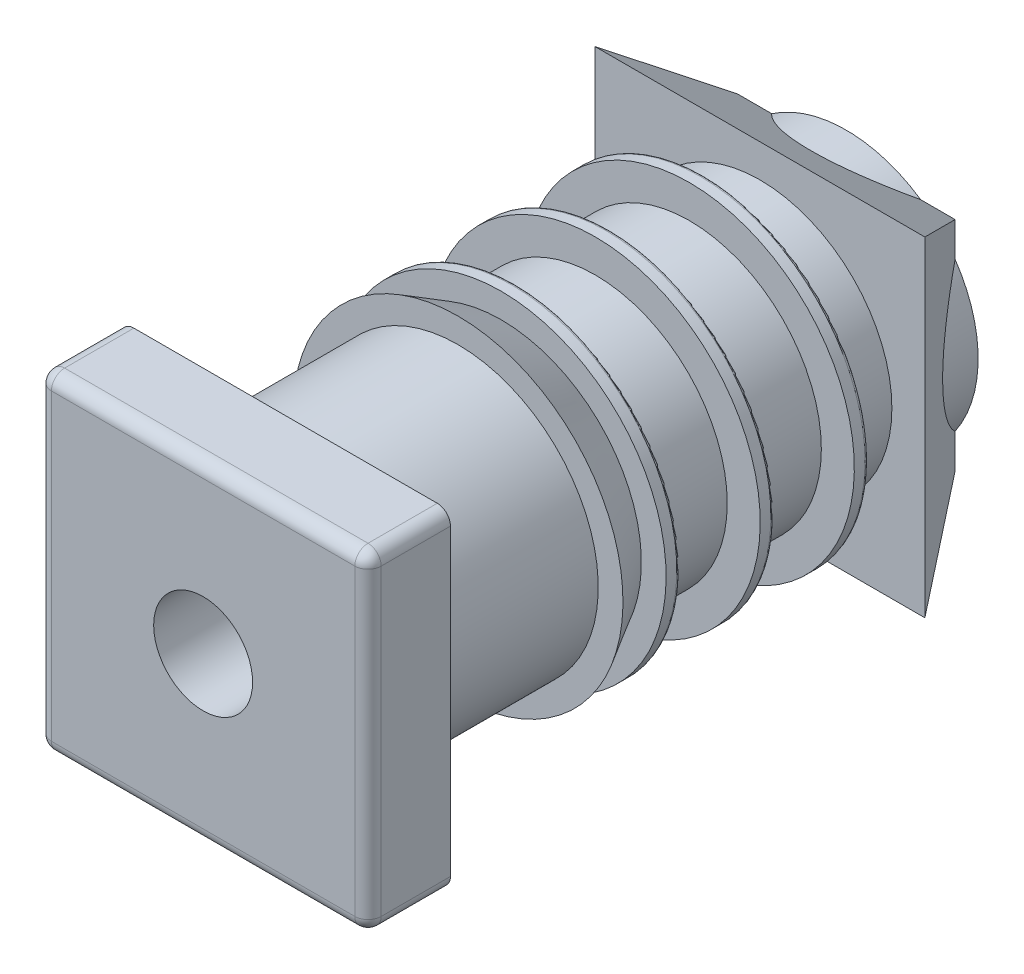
ISO-10303-21;
HEADER;
FILE_DESCRIPTION(('STEP AP214'),'2;1');
FILE_NAME('part.step','',(''),(''),'','','');
FILE_SCHEMA(('AUTOMOTIVE_DESIGN { 1 0 10303 214 1 1 1 1 }'));
ENDSEC;
DATA;
#1=APPLICATION_CONTEXT('core data for automotive mechanical design processes');
#2=APPLICATION_PROTOCOL_DEFINITION('international standard','automotive_design',2000,#1);
#3=PRODUCT_CONTEXT('',#1,'mechanical');
#4=PRODUCT('Part','Part','',(#3));
#5=PRODUCT_RELATED_PRODUCT_CATEGORY('part','',(#4));
#6=PRODUCT_DEFINITION_FORMATION('','',#4);
#7=PRODUCT_DEFINITION_CONTEXT('part definition',#1,'design');
#8=PRODUCT_DEFINITION('design','',#6,#7);
#9=PRODUCT_DEFINITION_SHAPE('','',#8);
#10=(LENGTH_UNIT() NAMED_UNIT(*) SI_UNIT(.MILLI.,.METRE.));
#11=(NAMED_UNIT(*) PLANE_ANGLE_UNIT() SI_UNIT($,.RADIAN.));
#12=(NAMED_UNIT(*) SI_UNIT($,.STERADIAN.) SOLID_ANGLE_UNIT());
#13=UNCERTAINTY_MEASURE_WITH_UNIT(LENGTH_MEASURE(1.E-05),#10,'distance_accuracy_value','');
#14=(GEOMETRIC_REPRESENTATION_CONTEXT(3) GLOBAL_UNCERTAINTY_ASSIGNED_CONTEXT((#13)) GLOBAL_UNIT_ASSIGNED_CONTEXT((#10,
#11,#12)) REPRESENTATION_CONTEXT('',''));
#15=CARTESIAN_POINT('',(0.,0.,0.));
#16=DIRECTION('',(0.,0.,1.));
#17=DIRECTION('',(1.,0.,0.));
#18=AXIS2_PLACEMENT_3D('',#15,#16,#17);
#19=CARTESIAN_POINT('',(-8.9,0.,-19.6340659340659));
#20=DIRECTION('',(0.,0.,-1.));
#21=DIRECTION('',(0.,-1.,0.));
#22=AXIS2_PLACEMENT_3D('',#19,#20,#21);
#23=PLANE('',#22);
#24=CARTESIAN_POINT('',(0.,0.,-19.6340659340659));
#25=DIRECTION('',(0.,0.,1.));
#26=DIRECTION('',(0.,-1.,0.));
#27=AXIS2_PLACEMENT_3D('',#24,#25,#26);
#28=CIRCLE('',#27,9.8);
#29=CARTESIAN_POINT('',(0.,-9.8,-19.6340659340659));
#30=VERTEX_POINT('',#29);
#31=CARTESIAN_POINT('',(0.,9.8,-19.6340659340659));
#32=VERTEX_POINT('',#31);
#33=EDGE_CURVE('E177',#30,#32,#28,.T.);
#34=ORIENTED_EDGE('',*,*,#33,.F.);
#35=CARTESIAN_POINT('',(0.,0.,-19.6340659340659));
#36=DIRECTION('',(0.,0.,1.));
#37=DIRECTION('',(-1.,0.,0.));
#38=AXIS2_PLACEMENT_3D('',#35,#36,#37);
#39=CIRCLE('',#38,9.8);
#40=CARTESIAN_POINT('',(-9.8,0.,-19.6340659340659));
#41=VERTEX_POINT('',#40);
#42=EDGE_CURVE('E170',#41,#30,#39,.T.);
#43=ORIENTED_EDGE('',*,*,#42,.F.);
#44=CARTESIAN_POINT('',(0.,0.,-19.6340659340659));
#45=DIRECTION('',(0.,0.,1.));
#46=DIRECTION('',(0.,1.,0.));
#47=AXIS2_PLACEMENT_3D('',#44,#45,#46);
#48=CIRCLE('',#47,9.8);
#49=EDGE_CURVE('E174',#32,#41,#48,.T.);
#50=ORIENTED_EDGE('',*,*,#49,.F.);
#51=EDGE_LOOP('',(#34,#43,#50));
#52=FACE_BOUND('',#51,.T.);
#53=CARTESIAN_POINT('',(0.,0.,-19.6340659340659));
#54=DIRECTION('',(0.,0.,1.));
#55=DIRECTION('',(0.,1.,0.));
#56=AXIS2_PLACEMENT_3D('',#53,#54,#55);
#57=CIRCLE('',#56,8.);
#58=CARTESIAN_POINT('',(0.,8.,-19.6340659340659));
#59=VERTEX_POINT('',#58);
#60=EDGE_CURVE('E187',#59,#59,#57,.F.);
#61=ORIENTED_EDGE('',*,*,#60,.F.);
#62=EDGE_LOOP('',(#61));
#63=FACE_BOUND('',#62,.T.);
#64=ADVANCED_FACE('F14',(#52,#63),#23,.T.);
#65=CARTESIAN_POINT('',(0.,0.,-22.0626373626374));
#66=DIRECTION('',(0.,0.,1.));
#67=DIRECTION('',(0.,1.,0.));
#68=AXIS2_PLACEMENT_3D('',#65,#66,#67);
#69=CYLINDRICAL_SURFACE('',#68,8.);
#70=CARTESIAN_POINT('',(0.,0.,-24.4912087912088));
#71=DIRECTION('',(0.,0.,1.));
#72=DIRECTION('',(0.,1.,0.));
#73=AXIS2_PLACEMENT_3D('',#70,#71,#72);
#74=CIRCLE('',#73,8.);
#75=CARTESIAN_POINT('',(0.,8.,-24.4912087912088));
#76=VERTEX_POINT('',#75);
#77=EDGE_CURVE('E338',#76,#76,#74,.F.);
#78=ORIENTED_EDGE('',*,*,#77,.F.);
#79=EDGE_LOOP('',(#78));
#80=FACE_BOUND('',#79,.T.);
#81=ORIENTED_EDGE('',*,*,#60,.T.);
#82=EDGE_LOOP('',(#81));
#83=FACE_BOUND('',#82,.T.);
#84=ADVANCED_FACE('F209',(#80,#83),#69,.T.);
#85=CARTESIAN_POINT('',(0.,0.,-19.4340659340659));
#86=DIRECTION('',(0.,0.,-1.));
#87=DIRECTION('',(0.,-1.,0.));
#88=AXIS2_PLACEMENT_3D('',#85,#86,#87);
#89=TOROIDAL_SURFACE('',#88,9.8,0.2);
#90=ORIENTED_EDGE('',*,*,#42,.T.);
#91=ORIENTED_EDGE('',*,*,#33,.T.);
#92=ORIENTED_EDGE('',*,*,#49,.T.);
#93=EDGE_LOOP('',(#90,#91,#92));
#94=FACE_BOUND('',#93,.T.);
#95=CARTESIAN_POINT('',(0.,0.,-19.4340659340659));
#96=DIRECTION('',(0.,0.,1.));
#97=DIRECTION('',(0.,1.,0.));
#98=AXIS2_PLACEMENT_3D('',#95,#96,#97);
#99=CIRCLE('',#98,10.);
#100=CARTESIAN_POINT('',(0.,10.,-19.4340659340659));
#101=VERTEX_POINT('',#100);
#102=EDGE_CURVE('E217',#101,#101,#99,.T.);
#103=ORIENTED_EDGE('',*,*,#102,.F.);
#104=EDGE_LOOP('',(#103));
#105=FACE_BOUND('',#104,.T.);
#106=ADVANCED_FACE('F184',(#94,#105),#89,.T.);
#107=CARTESIAN_POINT('',(-9.,0.,-24.4912087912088));
#108=DIRECTION('',(0.,0.,1.));
#109=DIRECTION('',(0.,1.,0.));
#110=AXIS2_PLACEMENT_3D('',#107,#108,#109);
#111=PLANE('',#110);
#112=ORIENTED_EDGE('',*,*,#77,.T.);
#113=EDGE_LOOP('',(#112));
#114=FACE_BOUND('',#113,.T.);
#115=CARTESIAN_POINT('',(0.,0.,-24.4912087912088));
#116=DIRECTION('',(0.,0.,1.));
#117=DIRECTION('',(0.,1.,0.));
#118=AXIS2_PLACEMENT_3D('',#115,#116,#117);
#119=CIRCLE('',#118,10.);
#120=CARTESIAN_POINT('',(0.,10.,-24.4912087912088));
#121=VERTEX_POINT('',#120);
#122=EDGE_CURVE('E335',#121,#121,#119,.F.);
#123=ORIENTED_EDGE('',*,*,#122,.F.);
#124=EDGE_LOOP('',(#123));
#125=FACE_BOUND('',#124,.T.);
#126=ADVANCED_FACE('F208',(#114,#125),#111,.T.);
#127=CARTESIAN_POINT('',(0.,0.,-19.1090659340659));
#128=DIRECTION('',(0.,0.,1.));
#129=DIRECTION('',(0.,1.,0.));
#130=AXIS2_PLACEMENT_3D('',#127,#128,#129);
#131=CYLINDRICAL_SURFACE('',#130,10.);
#132=ORIENTED_EDGE('',*,*,#102,.T.);
#133=EDGE_LOOP('',(#132));
#134=FACE_BOUND('',#133,.T.);
#135=CARTESIAN_POINT('',(0.,0.,-18.7840659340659));
#136=DIRECTION('',(0.,0.,1.));
#137=DIRECTION('',(0.,1.,0.));
#138=AXIS2_PLACEMENT_3D('',#135,#136,#137);
#139=CIRCLE('',#138,10.);
#140=CARTESIAN_POINT('',(0.,10.,-18.7840659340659));
#141=VERTEX_POINT('',#140);
#142=EDGE_CURVE('E332',#141,#141,#139,.T.);
#143=ORIENTED_EDGE('',*,*,#142,.F.);
#144=EDGE_LOOP('',(#143));
#145=FACE_BOUND('',#144,.T.);
#146=ADVANCED_FACE('F481',(#134,#145),#131,.T.);
#147=CARTESIAN_POINT('',(0.,0.,-24.8162087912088));
#148=DIRECTION('',(0.,0.,1.));
#149=DIRECTION('',(0.,1.,0.));
#150=AXIS2_PLACEMENT_3D('',#147,#148,#149);
#151=CYLINDRICAL_SURFACE('',#150,10.);
#152=ORIENTED_EDGE('',*,*,#122,.T.);
#153=EDGE_LOOP('',(#152));
#154=FACE_BOUND('',#153,.T.);
#155=CARTESIAN_POINT('',(0.,0.,-25.1412087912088));
#156=DIRECTION('',(0.,0.,-1.));
#157=DIRECTION('',(0.,-1.,0.));
#158=AXIS2_PLACEMENT_3D('',#155,#156,#157);
#159=CIRCLE('',#158,10.);
#160=CARTESIAN_POINT('',(0.,-10.,-25.1412087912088));
#161=VERTEX_POINT('',#160);
#162=EDGE_CURVE('E331',#161,#161,#159,.T.);
#163=ORIENTED_EDGE('',*,*,#162,.F.);
#164=EDGE_LOOP('',(#163));
#165=FACE_BOUND('',#164,.T.);
#166=ADVANCED_FACE('F479',(#154,#165),#151,.T.);
#167=CARTESIAN_POINT('',(-9.,0.,-18.7840659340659));
#168=DIRECTION('',(0.,0.,1.));
#169=DIRECTION('',(0.,1.,0.));
#170=AXIS2_PLACEMENT_3D('',#167,#168,#169);
#171=PLANE('',#170);
#172=CARTESIAN_POINT('',(0.,0.,-18.7840659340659));
#173=DIRECTION('',(0.,0.,1.));
#174=DIRECTION('',(0.,1.,0.));
#175=AXIS2_PLACEMENT_3D('',#172,#173,#174);
#176=CIRCLE('',#175,8.);
#177=CARTESIAN_POINT('',(0.,8.,-18.7840659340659));
#178=VERTEX_POINT('',#177);
#179=EDGE_CURVE('E327',#178,#178,#176,.T.);
#180=ORIENTED_EDGE('',*,*,#179,.F.);
#181=EDGE_LOOP('',(#180));
#182=FACE_BOUND('',#181,.T.);
#183=ORIENTED_EDGE('',*,*,#142,.T.);
#184=EDGE_LOOP('',(#183));
#185=FACE_BOUND('',#184,.T.);
#186=ADVANCED_FACE('F459',(#182,#185),#171,.T.);
#187=CARTESIAN_POINT('',(0.,0.,-25.1412087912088));
#188=DIRECTION('',(0.,0.,-1.));
#189=DIRECTION('',(0.,-1.,0.));
#190=AXIS2_PLACEMENT_3D('',#187,#188,#189);
#191=TOROIDAL_SURFACE('',#190,9.8,0.2);
#192=ORIENTED_EDGE('',*,*,#162,.T.);
#193=EDGE_LOOP('',(#192));
#194=FACE_BOUND('',#193,.T.);
#195=CARTESIAN_POINT('',(0.,0.,-25.3412087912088));
#196=DIRECTION('',(0.,0.,1.));
#197=DIRECTION('',(0.,1.,0.));
#198=AXIS2_PLACEMENT_3D('',#195,#196,#197);
#199=CIRCLE('',#198,9.8);
#200=CARTESIAN_POINT('',(-9.8,0.,-25.3412087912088));
#201=VERTEX_POINT('',#200);
#202=CARTESIAN_POINT('',(0.,9.8,-25.3412087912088));
#203=VERTEX_POINT('',#202);
#204=EDGE_CURVE('E330',#201,#203,#199,.F.);
#205=ORIENTED_EDGE('',*,*,#204,.F.);
#206=CARTESIAN_POINT('',(0.,0.,-25.3412087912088));
#207=DIRECTION('',(0.,0.,1.));
#208=DIRECTION('',(-1.,0.,0.));
#209=AXIS2_PLACEMENT_3D('',#206,#207,#208);
#210=CIRCLE('',#209,9.8);
#211=CARTESIAN_POINT('',(0.,-9.8,-25.3412087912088));
#212=VERTEX_POINT('',#211);
#213=EDGE_CURVE('E326',#212,#201,#210,.F.);
#214=ORIENTED_EDGE('',*,*,#213,.F.);
#215=CARTESIAN_POINT('',(0.,0.,-25.3412087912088));
#216=DIRECTION('',(0.,0.,1.));
#217=DIRECTION('',(0.,-1.,0.));
#218=AXIS2_PLACEMENT_3D('',#215,#216,#217);
#219=CIRCLE('',#218,9.8);
#220=EDGE_CURVE('E433',#203,#212,#219,.F.);
#221=ORIENTED_EDGE('',*,*,#220,.F.);
#222=EDGE_LOOP('',(#205,#214,#221));
#223=FACE_BOUND('',#222,.T.);
#224=ADVANCED_FACE('F454',(#194,#223),#191,.T.);
#225=CARTESIAN_POINT('',(0.,0.,-16.3554945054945));
#226=DIRECTION('',(0.,0.,1.));
#227=DIRECTION('',(0.,1.,0.));
#228=AXIS2_PLACEMENT_3D('',#225,#226,#227);
#229=CYLINDRICAL_SURFACE('',#228,8.);
#230=ORIENTED_EDGE('',*,*,#179,.T.);
#231=EDGE_LOOP('',(#230));
#232=FACE_BOUND('',#231,.T.);
#233=CARTESIAN_POINT('',(0.,0.,-13.9269230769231));
#234=DIRECTION('',(0.,0.,1.));
#235=DIRECTION('',(0.,1.,0.));
#236=AXIS2_PLACEMENT_3D('',#233,#234,#235);
#237=CIRCLE('',#236,8.);
#238=CARTESIAN_POINT('',(0.,8.,-13.9269230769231));
#239=VERTEX_POINT('',#238);
#240=EDGE_CURVE('E323',#239,#239,#237,.T.);
#241=ORIENTED_EDGE('',*,*,#240,.F.);
#242=EDGE_LOOP('',(#241));
#243=FACE_BOUND('',#242,.T.);
#244=ADVANCED_FACE('F458',(#232,#243),#229,.T.);
#245=CARTESIAN_POINT('',(-8.9,0.,-25.3412087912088));
#246=DIRECTION('',(0.,0.,-1.));
#247=DIRECTION('',(0.,-1.,0.));
#248=AXIS2_PLACEMENT_3D('',#245,#246,#247);
#249=PLANE('',#248);
#250=ORIENTED_EDGE('',*,*,#220,.T.);
#251=ORIENTED_EDGE('',*,*,#213,.T.);
#252=ORIENTED_EDGE('',*,*,#204,.T.);
#253=EDGE_LOOP('',(#250,#251,#252));
#254=FACE_BOUND('',#253,.T.);
#255=CARTESIAN_POINT('',(0.,0.,-25.3412087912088));
#256=DIRECTION('',(0.,0.,1.));
#257=DIRECTION('',(0.,1.,0.));
#258=AXIS2_PLACEMENT_3D('',#255,#256,#257);
#259=CIRCLE('',#258,8.);
#260=CARTESIAN_POINT('',(0.,8.,-25.3412087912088));
#261=VERTEX_POINT('',#260);
#262=EDGE_CURVE('E319',#261,#261,#259,.F.);
#263=ORIENTED_EDGE('',*,*,#262,.F.);
#264=EDGE_LOOP('',(#263));
#265=FACE_BOUND('',#264,.T.);
#266=ADVANCED_FACE('F391',(#254,#265),#249,.T.);
#267=CARTESIAN_POINT('',(-8.9,0.,-13.9269230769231));
#268=DIRECTION('',(0.,0.,-1.));
#269=DIRECTION('',(0.,-1.,0.));
#270=AXIS2_PLACEMENT_3D('',#267,#268,#269);
#271=PLANE('',#270);
#272=CARTESIAN_POINT('',(0.,0.,-13.9269230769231));
#273=DIRECTION('',(0.,0.,1.));
#274=DIRECTION('',(0.,-1.,0.));
#275=AXIS2_PLACEMENT_3D('',#272,#273,#274);
#276=CIRCLE('',#275,9.8);
#277=CARTESIAN_POINT('',(0.,-9.8,-13.9269230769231));
#278=VERTEX_POINT('',#277);
#279=CARTESIAN_POINT('',(0.,9.8,-13.9269230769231));
#280=VERTEX_POINT('',#279);
#281=EDGE_CURVE('E318',#278,#280,#276,.T.);
#282=ORIENTED_EDGE('',*,*,#281,.F.);
#283=CARTESIAN_POINT('',(0.,0.,-13.9269230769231));
#284=DIRECTION('',(0.,0.,1.));
#285=DIRECTION('',(-1.,0.,0.));
#286=AXIS2_PLACEMENT_3D('',#283,#284,#285);
#287=CIRCLE('',#286,9.8);
#288=CARTESIAN_POINT('',(-9.8,0.,-13.9269230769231));
#289=VERTEX_POINT('',#288);
#290=EDGE_CURVE('E408',#289,#278,#287,.T.);
#291=ORIENTED_EDGE('',*,*,#290,.F.);
#292=CARTESIAN_POINT('',(0.,0.,-13.9269230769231));
#293=DIRECTION('',(0.,0.,1.));
#294=DIRECTION('',(0.,1.,0.));
#295=AXIS2_PLACEMENT_3D('',#292,#293,#294);
#296=CIRCLE('',#295,9.8);
#297=EDGE_CURVE('E322',#280,#289,#296,.T.);
#298=ORIENTED_EDGE('',*,*,#297,.F.);
#299=EDGE_LOOP('',(#282,#291,#298));
#300=FACE_BOUND('',#299,.T.);
#301=ORIENTED_EDGE('',*,*,#240,.T.);
#302=EDGE_LOOP('',(#301));
#303=FACE_BOUND('',#302,.T.);
#304=ADVANCED_FACE('F382',(#300,#303),#271,.T.);
#305=CARTESIAN_POINT('',(0.,0.,-29.6706043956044));
#306=DIRECTION('',(0.,0.,1.));
#307=DIRECTION('',(0.,1.,0.));
#308=AXIS2_PLACEMENT_3D('',#305,#306,#307);
#309=CYLINDRICAL_SURFACE('',#308,8.);
#310=ORIENTED_EDGE('',*,*,#262,.T.);
#311=EDGE_LOOP('',(#310));
#312=FACE_BOUND('',#311,.T.);
#313=CARTESIAN_POINT('',(0.,0.,-28.7692307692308));
#314=DIRECTION('',(0.,0.,1.));
#315=DIRECTION('',(0.,1.,0.));
#316=AXIS2_PLACEMENT_3D('',#313,#314,#315);
#317=CIRCLE('',#316,8.);
#318=CARTESIAN_POINT('',(0.,8.,-28.7692307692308));
#319=VERTEX_POINT('',#318);
#320=EDGE_CURVE('E314',#319,#319,#317,.F.);
#321=ORIENTED_EDGE('',*,*,#320,.F.);
#322=EDGE_LOOP('',(#321));
#323=FACE_BOUND('',#322,.T.);
#324=ADVANCED_FACE('F365',(#312,#323),#309,.T.);
#325=CARTESIAN_POINT('',(0.,0.,-13.7269230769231));
#326=DIRECTION('',(0.,0.,-1.));
#327=DIRECTION('',(0.,-1.,0.));
#328=AXIS2_PLACEMENT_3D('',#325,#326,#327);
#329=TOROIDAL_SURFACE('',#328,9.8,0.2);
#330=ORIENTED_EDGE('',*,*,#290,.T.);
#331=ORIENTED_EDGE('',*,*,#281,.T.);
#332=ORIENTED_EDGE('',*,*,#297,.T.);
#333=EDGE_LOOP('',(#330,#331,#332));
#334=FACE_BOUND('',#333,.T.);
#335=CARTESIAN_POINT('',(0.,0.,-13.7269230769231));
#336=DIRECTION('',(0.,0.,1.));
#337=DIRECTION('',(0.,1.,0.));
#338=AXIS2_PLACEMENT_3D('',#335,#336,#337);
#339=CIRCLE('',#338,10.);
#340=CARTESIAN_POINT('',(0.,10.,-13.7269230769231));
#341=VERTEX_POINT('',#340);
#342=EDGE_CURVE('E317',#341,#341,#339,.T.);
#343=ORIENTED_EDGE('',*,*,#342,.F.);
#344=EDGE_LOOP('',(#343));
#345=FACE_BOUND('',#344,.T.);
#346=ADVANCED_FACE('F353',(#334,#345),#329,.T.);
#347=CARTESIAN_POINT('',(10.,-10.,-28.7692307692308));
#348=DIRECTION('',(0.,0.,1.));
#349=DIRECTION('',(0.,1.,0.));
#350=AXIS2_PLACEMENT_3D('',#347,#348,#349);
#351=PLANE('',#350);
#352=DIRECTION('',(-1.,0.,0.));
#353=VECTOR('',#352,1.);
#354=CARTESIAN_POINT('',(-10.,-10.,-28.7692307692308));
#355=LINE('',#354,#353);
#356=CARTESIAN_POINT('',(-10.,-10.,-28.7692307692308));
#357=VERTEX_POINT('',#356);
#358=CARTESIAN_POINT('',(10.,-10.,-28.7692307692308));
#359=VERTEX_POINT('',#358);
#360=EDGE_CURVE('E313',#357,#359,#355,.F.);
#361=ORIENTED_EDGE('',*,*,#360,.T.);
#362=DIRECTION('',(0.,-1.,0.));
#363=VECTOR('',#362,1.);
#364=CARTESIAN_POINT('',(10.,-10.,-28.7692307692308));
#365=LINE('',#364,#363);
#366=CARTESIAN_POINT('',(10.,10.,-28.7692307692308));
#367=VERTEX_POINT('',#366);
#368=EDGE_CURVE('E623',#367,#359,#365,.T.);
#369=ORIENTED_EDGE('',*,*,#368,.F.);
#370=DIRECTION('',(-1.,0.,0.));
#371=VECTOR('',#370,1.);
#372=CARTESIAN_POINT('',(-10.,10.,-28.7692307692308));
#373=LINE('',#372,#371);
#374=CARTESIAN_POINT('',(-10.,10.,-28.7692307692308));
#375=VERTEX_POINT('',#374);
#376=EDGE_CURVE('E625',#367,#375,#373,.T.);
#377=ORIENTED_EDGE('',*,*,#376,.T.);
#378=DIRECTION('',(0.,-1.,0.));
#379=VECTOR('',#378,1.);
#380=CARTESIAN_POINT('',(-10.,-10.,-28.7692307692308));
#381=LINE('',#380,#379);
#382=EDGE_CURVE('E626',#357,#375,#381,.F.);
#383=ORIENTED_EDGE('',*,*,#382,.F.);
#384=EDGE_LOOP('',(#361,#369,#377,#383));
#385=FACE_BOUND('',#384,.T.);
#386=ORIENTED_EDGE('',*,*,#320,.T.);
#387=EDGE_LOOP('',(#386));
#388=FACE_BOUND('',#387,.T.);
#389=ADVANCED_FACE('F364',(#385,#388),#351,.T.);
#390=CARTESIAN_POINT('',(0.,0.,-13.4019230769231));
#391=DIRECTION('',(0.,0.,1.));
#392=DIRECTION('',(0.,1.,0.));
#393=AXIS2_PLACEMENT_3D('',#390,#391,#392);
#394=CYLINDRICAL_SURFACE('',#393,10.);
#395=ORIENTED_EDGE('',*,*,#342,.T.);
#396=EDGE_LOOP('',(#395));
#397=FACE_BOUND('',#396,.T.);
#398=CARTESIAN_POINT('',(0.,0.,-13.0769230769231));
#399=DIRECTION('',(0.,0.,1.));
#400=DIRECTION('',(0.,1.,0.));
#401=AXIS2_PLACEMENT_3D('',#398,#399,#400);
#402=CIRCLE('',#401,10.);
#403=CARTESIAN_POINT('',(0.,10.,-13.0769230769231));
#404=VERTEX_POINT('',#403);
#405=EDGE_CURVE('E297',#404,#404,#402,.T.);
#406=ORIENTED_EDGE('',*,*,#405,.F.);
#407=EDGE_LOOP('',(#406));
#408=FACE_BOUND('',#407,.T.);
#409=ADVANCED_FACE('F603',(#397,#408),#394,.T.);
#410=CARTESIAN_POINT('',(0.,0.,-29.6706043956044));
#411=DIRECTION('',(0.,0.,1.));
#412=DIRECTION('',(0.,1.,0.));
#413=AXIS2_PLACEMENT_3D('',#410,#411,#412);
#414=CYLINDRICAL_SURFACE('',#413,8.);
#415=CARTESIAN_POINT('',(0.,0.,-44.1678804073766));
#416=DIRECTION('',(0.,0.838670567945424,0.544639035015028));
#417=DIRECTION('',(0.,-0.544639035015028,0.838670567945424));
#418=AXIS2_PLACEMENT_3D('',#415,#416,#417);
#419=ELLIPSE('',#418,14.6886276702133,8.);
#420=CARTESIAN_POINT('',(4.51653484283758,-6.60309874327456,-34.));
#421=VERTEX_POINT('',#420);
#422=CARTESIAN_POINT('',(-4.51653484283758,-6.60309874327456,-34.));
#423=VERTEX_POINT('',#422);
#424=EDGE_CURVE('E119',#421,#423,#419,.F.);
#425=ORIENTED_EDGE('',*,*,#424,.T.);
#426=CARTESIAN_POINT('',(0.,0.,-34.));
#427=DIRECTION('',(0.,0.,1.));
#428=DIRECTION('',(0.,1.,0.));
#429=AXIS2_PLACEMENT_3D('',#426,#427,#428);
#430=CIRCLE('',#429,8.);
#431=EDGE_CURVE('E292',#421,#423,#430,.F.);
#432=ORIENTED_EDGE('',*,*,#431,.F.);
#433=EDGE_LOOP('',(#425,#432));
#434=FACE_BOUND('',#433,.T.);
#435=ADVANCED_FACE('F601',(#434),#414,.T.);
#436=CARTESIAN_POINT('',(-10.,-10.,-28.7692307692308));
#437=DIRECTION('',(0.,0.838670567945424,0.544639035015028));
#438=DIRECTION('',(0.,0.544639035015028,-0.838670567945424));
#439=AXIS2_PLACEMENT_3D('',#436,#437,#438);
#440=PLANE('',#439);
#441=DIRECTION('',(-1.,0.,0.));
#442=VECTOR('',#441,1.);
#443=CARTESIAN_POINT('',(-6.60309874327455,-6.60309874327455,-34.));
#444=LINE('',#443,#442);
#445=CARTESIAN_POINT('',(6.60309874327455,-6.60309874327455,-34.));
#446=VERTEX_POINT('',#445);
#447=EDGE_CURVE('E296',#446,#421,#444,.T.);
#448=ORIENTED_EDGE('',*,*,#447,.F.);
#449=DIRECTION('',(-0.47830007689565,0.478300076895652,-0.73651753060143));
#450=VECTOR('',#449,1.);
#451=CARTESIAN_POINT('',(10.,-10.,-28.7692307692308));
#452=LINE('',#451,#450);
#453=EDGE_CURVE('E126',#359,#446,#452,.T.);
#454=ORIENTED_EDGE('',*,*,#453,.F.);
#455=ORIENTED_EDGE('',*,*,#360,.F.);
#456=DIRECTION('',(-0.47830007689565,-0.478300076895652,0.73651753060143));
#457=VECTOR('',#456,1.);
#458=CARTESIAN_POINT('',(-6.60309874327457,-6.60309874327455,-34.));
#459=LINE('',#458,#457);
#460=CARTESIAN_POINT('',(-6.60309874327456,-6.60309874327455,-34.));
#461=VERTEX_POINT('',#460);
#462=EDGE_CURVE('E311',#461,#357,#459,.T.);
#463=ORIENTED_EDGE('',*,*,#462,.F.);
#464=DIRECTION('',(-1.,0.,0.));
#465=VECTOR('',#464,1.);
#466=CARTESIAN_POINT('',(-6.60309874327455,-6.60309874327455,-34.));
#467=LINE('',#466,#465);
#468=EDGE_CURVE('E295',#423,#461,#467,.T.);
#469=ORIENTED_EDGE('',*,*,#468,.F.);
#470=ORIENTED_EDGE('',*,*,#424,.F.);
#471=EDGE_LOOP('',(#448,#454,#455,#463,#469,#470));
#472=FACE_BOUND('',#471,.T.);
#473=ADVANCED_FACE('F597',(#472),#440,.F.);
#474=CARTESIAN_POINT('',(0.,0.,-29.6706043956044));
#475=DIRECTION('',(0.,0.,1.));
#476=DIRECTION('',(0.,1.,0.));
#477=AXIS2_PLACEMENT_3D('',#474,#475,#476);
#478=CYLINDRICAL_SURFACE('',#477,8.);
#479=CARTESIAN_POINT('',(0.,0.,-44.1678804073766));
#480=DIRECTION('',(-0.838670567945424,0.,-0.544639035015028));
#481=DIRECTION('',(-0.544639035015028,0.,0.838670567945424));
#482=AXIS2_PLACEMENT_3D('',#479,#480,#481);
#483=ELLIPSE('',#482,14.6886276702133,8.);
#484=CARTESIAN_POINT('',(-6.60309874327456,4.51653484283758,-34.));
#485=VERTEX_POINT('',#484);
#486=CARTESIAN_POINT('',(-6.60309874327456,-4.51653484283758,-34.));
#487=VERTEX_POINT('',#486);
#488=EDGE_CURVE('E308',#485,#487,#483,.F.);
#489=ORIENTED_EDGE('',*,*,#488,.F.);
#490=CARTESIAN_POINT('',(0.,0.,-34.));
#491=DIRECTION('',(0.,0.,1.));
#492=DIRECTION('',(0.,1.,0.));
#493=AXIS2_PLACEMENT_3D('',#490,#491,#492);
#494=CIRCLE('',#493,8.);
#495=EDGE_CURVE('E287',#487,#485,#494,.F.);
#496=ORIENTED_EDGE('',*,*,#495,.F.);
#497=EDGE_LOOP('',(#489,#496));
#498=FACE_BOUND('',#497,.T.);
#499=ADVANCED_FACE('F593',(#498),#478,.T.);
#500=CARTESIAN_POINT('',(-10.,-10.,-28.7692307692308));
#501=DIRECTION('',(-0.838670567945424,0.,-0.544639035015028));
#502=DIRECTION('',(0.544639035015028,0.,-0.838670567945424));
#503=AXIS2_PLACEMENT_3D('',#500,#501,#502);
#504=PLANE('',#503);
#505=DIRECTION('',(0.478300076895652,-0.47830007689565,-0.73651753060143));
#506=VECTOR('',#505,1.);
#507=CARTESIAN_POINT('',(-10.,10.,-28.7692307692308));
#508=LINE('',#507,#506);
#509=CARTESIAN_POINT('',(-6.60309874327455,6.60309874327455,-34.));
#510=VERTEX_POINT('',#509);
#511=EDGE_CURVE('E307',#375,#510,#508,.T.);
#512=ORIENTED_EDGE('',*,*,#511,.T.);
#513=DIRECTION('',(0.,-1.,0.));
#514=VECTOR('',#513,1.);
#515=CARTESIAN_POINT('',(-6.60309874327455,-10.,-34.));
#516=LINE('',#515,#514);
#517=EDGE_CURVE('E290',#485,#510,#516,.F.);
#518=ORIENTED_EDGE('',*,*,#517,.F.);
#519=ORIENTED_EDGE('',*,*,#488,.T.);
#520=DIRECTION('',(0.,-1.,0.));
#521=VECTOR('',#520,1.);
#522=CARTESIAN_POINT('',(-6.60309874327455,-10.,-34.));
#523=LINE('',#522,#521);
#524=EDGE_CURVE('E291',#461,#487,#523,.F.);
#525=ORIENTED_EDGE('',*,*,#524,.F.);
#526=ORIENTED_EDGE('',*,*,#462,.T.);
#527=ORIENTED_EDGE('',*,*,#382,.T.);
#528=EDGE_LOOP('',(#512,#518,#519,#525,#526,#527));
#529=FACE_BOUND('',#528,.T.);
#530=ADVANCED_FACE('F589',(#529),#504,.T.);
#531=CARTESIAN_POINT('',(0.,0.,-29.6706043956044));
#532=DIRECTION('',(0.,0.,1.));
#533=DIRECTION('',(0.,1.,0.));
#534=AXIS2_PLACEMENT_3D('',#531,#532,#533);
#535=CYLINDRICAL_SURFACE('',#534,8.);
#536=CARTESIAN_POINT('',(0.,0.,-44.1678804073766));
#537=DIRECTION('',(0.,-0.838670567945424,0.544639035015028));
#538=DIRECTION('',(0.,0.544639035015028,0.838670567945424));
#539=AXIS2_PLACEMENT_3D('',#536,#537,#538);
#540=ELLIPSE('',#539,14.6886276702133,8.);
#541=CARTESIAN_POINT('',(-4.5165348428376,6.60309874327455,-34.));
#542=VERTEX_POINT('',#541);
#543=CARTESIAN_POINT('',(4.5165348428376,6.60309874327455,-34.));
#544=VERTEX_POINT('',#543);
#545=EDGE_CURVE('E304',#542,#544,#540,.F.);
#546=ORIENTED_EDGE('',*,*,#545,.T.);
#547=CARTESIAN_POINT('',(0.,0.,-34.));
#548=DIRECTION('',(0.,0.,1.));
#549=DIRECTION('',(0.,1.,0.));
#550=AXIS2_PLACEMENT_3D('',#547,#548,#549);
#551=CIRCLE('',#550,8.);
#552=EDGE_CURVE('E282',#542,#544,#551,.F.);
#553=ORIENTED_EDGE('',*,*,#552,.F.);
#554=EDGE_LOOP('',(#546,#553));
#555=FACE_BOUND('',#554,.T.);
#556=ADVANCED_FACE('F585',(#555),#535,.T.);
#557=CARTESIAN_POINT('',(-10.,6.60309874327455,-34.));
#558=DIRECTION('',(0.,-0.838670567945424,0.544639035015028));
#559=DIRECTION('',(0.,0.544639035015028,0.838670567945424));
#560=AXIS2_PLACEMENT_3D('',#557,#558,#559);
#561=PLANE('',#560);
#562=DIRECTION('',(-1.,0.,0.));
#563=VECTOR('',#562,1.);
#564=CARTESIAN_POINT('',(-6.60309874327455,6.60309874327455,-34.));
#565=LINE('',#564,#563);
#566=EDGE_CURVE('E286',#510,#542,#565,.F.);
#567=ORIENTED_EDGE('',*,*,#566,.F.);
#568=ORIENTED_EDGE('',*,*,#511,.F.);
#569=ORIENTED_EDGE('',*,*,#376,.F.);
#570=DIRECTION('',(0.47830007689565,0.478300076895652,0.73651753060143));
#571=VECTOR('',#570,1.);
#572=CARTESIAN_POINT('',(6.60309874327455,6.60309874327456,-34.));
#573=LINE('',#572,#571);
#574=CARTESIAN_POINT('',(6.60309874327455,6.60309874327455,-34.));
#575=VERTEX_POINT('',#574);
#576=EDGE_CURVE('E306',#575,#367,#573,.T.);
#577=ORIENTED_EDGE('',*,*,#576,.F.);
#578=DIRECTION('',(-1.,0.,0.));
#579=VECTOR('',#578,1.);
#580=CARTESIAN_POINT('',(-6.60309874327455,6.60309874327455,-34.));
#581=LINE('',#580,#579);
#582=EDGE_CURVE('E285',#544,#575,#581,.F.);
#583=ORIENTED_EDGE('',*,*,#582,.F.);
#584=ORIENTED_EDGE('',*,*,#545,.F.);
#585=EDGE_LOOP('',(#567,#568,#569,#577,#583,#584));
#586=FACE_BOUND('',#585,.T.);
#587=ADVANCED_FACE('F582',(#586),#561,.F.);
#588=CARTESIAN_POINT('',(6.60309874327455,-10.,-34.));
#589=DIRECTION('',(0.838670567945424,0.,-0.544639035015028));
#590=DIRECTION('',(0.544639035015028,0.,0.838670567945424));
#591=AXIS2_PLACEMENT_3D('',#588,#589,#590);
#592=PLANE('',#591);
#593=ORIENTED_EDGE('',*,*,#453,.T.);
#594=DIRECTION('',(0.,-1.,0.));
#595=VECTOR('',#594,1.);
#596=CARTESIAN_POINT('',(6.60309874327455,-10.,-34.));
#597=LINE('',#596,#595);
#598=CARTESIAN_POINT('',(6.60309874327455,-4.5165348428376,-34.));
#599=VERTEX_POINT('',#598);
#600=EDGE_CURVE('E300',#599,#446,#597,.T.);
#601=ORIENTED_EDGE('',*,*,#600,.F.);
#602=CARTESIAN_POINT('',(0.,0.,-44.1678804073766));
#603=DIRECTION('',(0.838670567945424,0.,-0.544639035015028));
#604=DIRECTION('',(0.544639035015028,0.,0.838670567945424));
#605=AXIS2_PLACEMENT_3D('',#602,#603,#604);
#606=ELLIPSE('',#605,14.6886276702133,8.);
#607=CARTESIAN_POINT('',(6.60309874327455,4.5165348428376,-34.));
#608=VERTEX_POINT('',#607);
#609=EDGE_CURVE('E301',#608,#599,#606,.T.);
#610=ORIENTED_EDGE('',*,*,#609,.F.);
#611=DIRECTION('',(0.,-1.,0.));
#612=VECTOR('',#611,1.);
#613=CARTESIAN_POINT('',(6.60309874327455,-10.,-34.));
#614=LINE('',#613,#612);
#615=EDGE_CURVE('E281',#575,#608,#614,.T.);
#616=ORIENTED_EDGE('',*,*,#615,.F.);
#617=ORIENTED_EDGE('',*,*,#576,.T.);
#618=ORIENTED_EDGE('',*,*,#368,.T.);
#619=EDGE_LOOP('',(#593,#601,#610,#616,#617,#618));
#620=FACE_BOUND('',#619,.T.);
#621=ADVANCED_FACE('F578',(#620),#592,.T.);
#622=CARTESIAN_POINT('',(0.,0.,-29.6706043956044));
#623=DIRECTION('',(0.,0.,1.));
#624=DIRECTION('',(0.,1.,0.));
#625=AXIS2_PLACEMENT_3D('',#622,#623,#624);
#626=CYLINDRICAL_SURFACE('',#625,8.);
#627=ORIENTED_EDGE('',*,*,#609,.T.);
#628=CARTESIAN_POINT('',(0.,0.,-34.));
#629=DIRECTION('',(0.,0.,1.));
#630=DIRECTION('',(0.,1.,0.));
#631=AXIS2_PLACEMENT_3D('',#628,#629,#630);
#632=CIRCLE('',#631,8.);
#633=EDGE_CURVE('E278',#608,#599,#632,.F.);
#634=ORIENTED_EDGE('',*,*,#633,.F.);
#635=EDGE_LOOP('',(#627,#634));
#636=FACE_BOUND('',#635,.T.);
#637=ADVANCED_FACE('F574',(#636),#626,.T.);
#638=CARTESIAN_POINT('',(-9.25,0.,-13.0769230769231));
#639=DIRECTION('',(0.,0.,1.));
#640=DIRECTION('',(0.,1.,0.));
#641=AXIS2_PLACEMENT_3D('',#638,#639,#640);
#642=PLANE('',#641);
#643=CARTESIAN_POINT('',(0.,0.,-13.0769230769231));
#644=DIRECTION('',(0.,0.,1.));
#645=DIRECTION('',(0.,1.,0.));
#646=AXIS2_PLACEMENT_3D('',#643,#644,#645);
#647=CIRCLE('',#646,8.5);
#648=CARTESIAN_POINT('',(0.,8.5,-13.0769230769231));
#649=VERTEX_POINT('',#648);
#650=EDGE_CURVE('E275',#649,#649,#647,.T.);
#651=ORIENTED_EDGE('',*,*,#650,.F.);
#652=EDGE_LOOP('',(#651));
#653=FACE_BOUND('',#652,.T.);
#654=ORIENTED_EDGE('',*,*,#405,.T.);
#655=EDGE_LOOP('',(#654));
#656=FACE_BOUND('',#655,.T.);
#657=ADVANCED_FACE('F570',(#653,#656),#642,.T.);
#658=CARTESIAN_POINT('',(-6.60309874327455,-10.,-34.));
#659=DIRECTION('',(0.,0.,-1.));
#660=DIRECTION('',(0.,-1.,0.));
#661=AXIS2_PLACEMENT_3D('',#658,#659,#660);
#662=PLANE('',#661);
#663=ORIENTED_EDGE('',*,*,#615,.T.);
#664=ORIENTED_EDGE('',*,*,#633,.T.);
#665=ORIENTED_EDGE('',*,*,#600,.T.);
#666=ORIENTED_EDGE('',*,*,#447,.T.);
#667=ORIENTED_EDGE('',*,*,#431,.T.);
#668=ORIENTED_EDGE('',*,*,#468,.T.);
#669=ORIENTED_EDGE('',*,*,#524,.T.);
#670=ORIENTED_EDGE('',*,*,#495,.T.);
#671=ORIENTED_EDGE('',*,*,#517,.T.);
#672=ORIENTED_EDGE('',*,*,#566,.T.);
#673=ORIENTED_EDGE('',*,*,#552,.T.);
#674=ORIENTED_EDGE('',*,*,#582,.T.);
#675=EDGE_LOOP('',(#663,#664,#665,#666,#667,#668,#669,#670,#671,#672,#673,#674));
#676=FACE_BOUND('',#675,.T.);
#677=CARTESIAN_POINT('',(0.,0.,-34.));
#678=DIRECTION('',(0.,0.,-1.));
#679=DIRECTION('',(0.,-1.,0.));
#680=AXIS2_PLACEMENT_3D('',#677,#678,#679);
#681=CIRCLE('',#680,3.);
#682=CARTESIAN_POINT('',(0.,-3.,-34.));
#683=VERTEX_POINT('',#682);
#684=EDGE_CURVE('E711',#683,#683,#681,.T.);
#685=ORIENTED_EDGE('',*,*,#684,.F.);
#686=EDGE_LOOP('',(#685));
#687=FACE_BOUND('',#686,.T.);
#688=ADVANCED_FACE('F566',(#676,#687),#662,.T.);
#689=CARTESIAN_POINT('',(0.,0.,-10.4615384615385));
#690=DIRECTION('',(0.,0.,1.));
#691=DIRECTION('',(0.,1.,0.));
#692=AXIS2_PLACEMENT_3D('',#689,#690,#691);
#693=CONICAL_SURFACE('',#692,10.,0.520728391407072);
#694=ORIENTED_EDGE('',*,*,#650,.T.);
#695=EDGE_LOOP('',(#694));
#696=FACE_BOUND('',#695,.T.);
#697=CARTESIAN_POINT('',(0.,0.,-10.4615384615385));
#698=DIRECTION('',(0.,0.,1.));
#699=DIRECTION('',(0.,1.,0.));
#700=AXIS2_PLACEMENT_3D('',#697,#698,#699);
#701=CIRCLE('',#700,10.);
#702=CARTESIAN_POINT('',(0.,10.,-10.4615384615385));
#703=VERTEX_POINT('',#702);
#704=EDGE_CURVE('E272',#703,#703,#701,.T.);
#705=ORIENTED_EDGE('',*,*,#704,.F.);
#706=EDGE_LOOP('',(#705));
#707=FACE_BOUND('',#706,.T.);
#708=ADVANCED_FACE('F562',(#696,#707),#693,.T.);
#709=CARTESIAN_POINT('',(-9.25,0.,-10.4615384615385));
#710=DIRECTION('',(0.,0.,1.));
#711=DIRECTION('',(0.,1.,0.));
#712=AXIS2_PLACEMENT_3D('',#709,#710,#711);
#713=PLANE('',#712);
#714=CARTESIAN_POINT('',(0.,0.,-10.4615384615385));
#715=DIRECTION('',(0.,0.,1.));
#716=DIRECTION('',(0.,1.,0.));
#717=AXIS2_PLACEMENT_3D('',#714,#715,#716);
#718=CIRCLE('',#717,8.5);
#719=CARTESIAN_POINT('',(0.,8.5,-10.4615384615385));
#720=VERTEX_POINT('',#719);
#721=EDGE_CURVE('E269',#720,#720,#718,.T.);
#722=ORIENTED_EDGE('',*,*,#721,.F.);
#723=EDGE_LOOP('',(#722));
#724=FACE_BOUND('',#723,.T.);
#725=ORIENTED_EDGE('',*,*,#704,.T.);
#726=EDGE_LOOP('',(#725));
#727=FACE_BOUND('',#726,.T.);
#728=ADVANCED_FACE('F558',(#724,#727),#713,.T.);
#729=CARTESIAN_POINT('',(0.,0.,-2.73076923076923));
#730=DIRECTION('',(0.,0.,1.));
#731=DIRECTION('',(0.,1.,0.));
#732=AXIS2_PLACEMENT_3D('',#729,#730,#731);
#733=CYLINDRICAL_SURFACE('',#732,8.5);
#734=CARTESIAN_POINT('',(0.,0.,0.));
#735=DIRECTION('',(0.,0.,1.));
#736=DIRECTION('',(0.,1.,0.));
#737=AXIS2_PLACEMENT_3D('',#734,#735,#736);
#738=CIRCLE('',#737,8.5);
#739=CARTESIAN_POINT('',(0.,8.5,0.));
#740=VERTEX_POINT('',#739);
#741=EDGE_CURVE('E260',#740,#740,#738,.T.);
#742=ORIENTED_EDGE('',*,*,#741,.F.);
#743=EDGE_LOOP('',(#742));
#744=FACE_BOUND('',#743,.T.);
#745=ORIENTED_EDGE('',*,*,#721,.T.);
#746=EDGE_LOOP('',(#745));
#747=FACE_BOUND('',#746,.T.);
#748=ADVANCED_FACE('F554',(#744,#747),#733,.T.);
#749=CARTESIAN_POINT('',(9.2,-9.2,5.));
#750=DIRECTION('',(0.,0.,1.));
#751=DIRECTION('',(0.,1.,0.));
#752=AXIS2_PLACEMENT_3D('',#749,#750,#751);
#753=CYLINDRICAL_SURFACE('',#752,0.8);
#754=DIRECTION('',(0.,0.,-1.));
#755=VECTOR('',#754,1.);
#756=CARTESIAN_POINT('',(10.,-9.2,5.));
#757=LINE('',#756,#755);
#758=CARTESIAN_POINT('',(10.,-9.2,4.2));
#759=VERTEX_POINT('',#758);
#760=CARTESIAN_POINT('',(10.,-9.2,0.));
#761=VERTEX_POINT('',#760);
#762=EDGE_CURVE('E659',#759,#761,#757,.T.);
#763=ORIENTED_EDGE('',*,*,#762,.F.);
#764=CARTESIAN_POINT('',(9.2,-9.2,4.2));
#765=DIRECTION('',(0.,0.,1.));
#766=DIRECTION('',(1.,0.,0.));
#767=AXIS2_PLACEMENT_3D('',#764,#765,#766);
#768=CIRCLE('',#767,0.8);
#769=CARTESIAN_POINT('',(9.2,-10.,4.2));
#770=VERTEX_POINT('',#769);
#771=EDGE_CURVE('E705',#759,#770,#768,.F.);
#772=ORIENTED_EDGE('',*,*,#771,.T.);
#773=DIRECTION('',(0.,0.,-1.));
#774=VECTOR('',#773,1.);
#775=CARTESIAN_POINT('',(9.2,-10.,5.));
#776=LINE('',#775,#774);
#777=CARTESIAN_POINT('',(9.2,-10.,0.));
#778=VERTEX_POINT('',#777);
#779=EDGE_CURVE('E654',#778,#770,#776,.F.);
#780=ORIENTED_EDGE('',*,*,#779,.F.);
#781=CARTESIAN_POINT('',(9.2,-9.2,0.));
#782=DIRECTION('',(0.,0.,1.));
#783=DIRECTION('',(0.,1.,0.));
#784=AXIS2_PLACEMENT_3D('',#781,#782,#783);
#785=CIRCLE('',#784,0.8);
#786=EDGE_CURVE('E265',#761,#778,#785,.F.);
#787=ORIENTED_EDGE('',*,*,#786,.F.);
#788=EDGE_LOOP('',(#763,#772,#780,#787));
#789=FACE_BOUND('',#788,.T.);
#790=ADVANCED_FACE('F550',(#789),#753,.T.);
#791=CARTESIAN_POINT('',(9.2,9.2,5.));
#792=DIRECTION('',(0.,0.,1.));
#793=DIRECTION('',(0.,1.,0.));
#794=AXIS2_PLACEMENT_3D('',#791,#792,#793);
#795=CYLINDRICAL_SURFACE('',#794,0.8);
#796=DIRECTION('',(0.,0.,-1.));
#797=VECTOR('',#796,1.);
#798=CARTESIAN_POINT('',(9.2,10.,5.));
#799=LINE('',#798,#797);
#800=CARTESIAN_POINT('',(9.2,10.,4.2));
#801=VERTEX_POINT('',#800);
#802=CARTESIAN_POINT('',(9.2,10.,0.));
#803=VERTEX_POINT('',#802);
#804=EDGE_CURVE('E664',#801,#803,#799,.T.);
#805=ORIENTED_EDGE('',*,*,#804,.F.);
#806=CARTESIAN_POINT('',(9.2,9.2,4.2));
#807=DIRECTION('',(0.,0.,1.));
#808=DIRECTION('',(1.,0.,0.));
#809=AXIS2_PLACEMENT_3D('',#806,#807,#808);
#810=CIRCLE('',#809,0.8);
#811=CARTESIAN_POINT('',(10.,9.2,4.2));
#812=VERTEX_POINT('',#811);
#813=EDGE_CURVE('E9',#801,#812,#810,.F.);
#814=ORIENTED_EDGE('',*,*,#813,.T.);
#815=DIRECTION('',(0.,0.,-1.));
#816=VECTOR('',#815,1.);
#817=CARTESIAN_POINT('',(10.,9.2,5.));
#818=LINE('',#817,#816);
#819=CARTESIAN_POINT('',(10.,9.2,0.));
#820=VERTEX_POINT('',#819);
#821=EDGE_CURVE('E658',#820,#812,#818,.F.);
#822=ORIENTED_EDGE('',*,*,#821,.F.);
#823=CARTESIAN_POINT('',(9.2,9.2,0.));
#824=DIRECTION('',(0.,0.,1.));
#825=DIRECTION('',(0.,1.,0.));
#826=AXIS2_PLACEMENT_3D('',#823,#824,#825);
#827=CIRCLE('',#826,0.8);
#828=EDGE_CURVE('E267',#803,#820,#827,.F.);
#829=ORIENTED_EDGE('',*,*,#828,.F.);
#830=EDGE_LOOP('',(#805,#814,#822,#829));
#831=FACE_BOUND('',#830,.T.);
#832=ADVANCED_FACE('F546',(#831),#795,.T.);
#833=CARTESIAN_POINT('',(-9.2,9.2,5.));
#834=DIRECTION('',(0.,0.,1.));
#835=DIRECTION('',(0.,1.,0.));
#836=AXIS2_PLACEMENT_3D('',#833,#834,#835);
#837=CYLINDRICAL_SURFACE('',#836,0.8);
#838=DIRECTION('',(0.,0.,-1.));
#839=VECTOR('',#838,1.);
#840=CARTESIAN_POINT('',(-10.,9.2,5.));
#841=LINE('',#840,#839);
#842=CARTESIAN_POINT('',(-10.,9.2,4.2));
#843=VERTEX_POINT('',#842);
#844=CARTESIAN_POINT('',(-10.,9.2,0.));
#845=VERTEX_POINT('',#844);
#846=EDGE_CURVE('E669',#843,#845,#841,.T.);
#847=ORIENTED_EDGE('',*,*,#846,.F.);
#848=CARTESIAN_POINT('',(-9.2,9.2,4.2));
#849=DIRECTION('',(0.,0.,1.));
#850=DIRECTION('',(1.,0.,0.));
#851=AXIS2_PLACEMENT_3D('',#848,#849,#850);
#852=CIRCLE('',#851,0.8);
#853=CARTESIAN_POINT('',(-9.2,10.,4.2));
#854=VERTEX_POINT('',#853);
#855=EDGE_CURVE('E727',#843,#854,#852,.F.);
#856=ORIENTED_EDGE('',*,*,#855,.T.);
#857=DIRECTION('',(0.,0.,-1.));
#858=VECTOR('',#857,1.);
#859=CARTESIAN_POINT('',(-9.2,10.,5.));
#860=LINE('',#859,#858);
#861=CARTESIAN_POINT('',(-9.2,10.,0.));
#862=VERTEX_POINT('',#861);
#863=EDGE_CURVE('E663',#862,#854,#860,.F.);
#864=ORIENTED_EDGE('',*,*,#863,.F.);
#865=CARTESIAN_POINT('',(-9.2,9.2,0.));
#866=DIRECTION('',(0.,0.,1.));
#867=DIRECTION('',(0.,1.,0.));
#868=AXIS2_PLACEMENT_3D('',#865,#866,#867);
#869=CIRCLE('',#868,0.8);
#870=EDGE_CURVE('E263',#845,#862,#869,.F.);
#871=ORIENTED_EDGE('',*,*,#870,.F.);
#872=EDGE_LOOP('',(#847,#856,#864,#871));
#873=FACE_BOUND('',#872,.T.);
#874=ADVANCED_FACE('F542',(#873),#837,.T.);
#875=CARTESIAN_POINT('',(0.,0.,0.));
#876=DIRECTION('',(0.,0.,-1.));
#877=DIRECTION('',(0.,-1.,0.));
#878=AXIS2_PLACEMENT_3D('',#875,#876,#877);
#879=PLANE('',#878);
#880=ORIENTED_EDGE('',*,*,#741,.T.);
#881=EDGE_LOOP('',(#880));
#882=FACE_BOUND('',#881,.T.);
#883=ORIENTED_EDGE('',*,*,#870,.T.);
#884=DIRECTION('',(1.,0.,0.));
#885=VECTOR('',#884,1.);
#886=CARTESIAN_POINT('',(9.2,10.,0.));
#887=LINE('',#886,#885);
#888=EDGE_CURVE('E660',#803,#862,#887,.F.);
#889=ORIENTED_EDGE('',*,*,#888,.F.);
#890=ORIENTED_EDGE('',*,*,#828,.T.);
#891=DIRECTION('',(0.,-1.,0.));
#892=VECTOR('',#891,1.);
#893=CARTESIAN_POINT('',(10.,-9.2,0.));
#894=LINE('',#893,#892);
#895=EDGE_CURVE('E655',#761,#820,#894,.F.);
#896=ORIENTED_EDGE('',*,*,#895,.F.);
#897=ORIENTED_EDGE('',*,*,#786,.T.);
#898=DIRECTION('',(-1.,0.,0.));
#899=VECTOR('',#898,1.);
#900=CARTESIAN_POINT('',(-9.2,-10.,0.));
#901=LINE('',#900,#899);
#902=CARTESIAN_POINT('',(-9.2,-10.,0.));
#903=VERTEX_POINT('',#902);
#904=EDGE_CURVE('E651',#903,#778,#901,.F.);
#905=ORIENTED_EDGE('',*,*,#904,.F.);
#906=CARTESIAN_POINT('',(-9.2,-9.2,0.));
#907=DIRECTION('',(0.,0.,1.));
#908=DIRECTION('',(0.,1.,0.));
#909=AXIS2_PLACEMENT_3D('',#906,#907,#908);
#910=CIRCLE('',#909,0.8);
#911=CARTESIAN_POINT('',(-10.,-9.2,0.));
#912=VERTEX_POINT('',#911);
#913=EDGE_CURVE('E252',#912,#903,#910,.T.);
#914=ORIENTED_EDGE('',*,*,#913,.F.);
#915=DIRECTION('',(0.,1.,0.));
#916=VECTOR('',#915,1.);
#917=CARTESIAN_POINT('',(-10.,9.2,0.));
#918=LINE('',#917,#916);
#919=EDGE_CURVE('E665',#845,#912,#918,.F.);
#920=ORIENTED_EDGE('',*,*,#919,.F.);
#921=EDGE_LOOP('',(#883,#889,#890,#896,#897,#905,#914,#920));
#922=FACE_BOUND('',#921,.T.);
#923=ADVANCED_FACE('F538',(#882,#922),#879,.T.);
#924=CARTESIAN_POINT('',(-9.2,-9.2,5.));
#925=DIRECTION('',(0.,0.,1.));
#926=DIRECTION('',(0.,1.,0.));
#927=AXIS2_PLACEMENT_3D('',#924,#925,#926);
#928=CYLINDRICAL_SURFACE('',#927,0.8);
#929=DIRECTION('',(0.,0.,-1.));
#930=VECTOR('',#929,1.);
#931=CARTESIAN_POINT('',(-9.2,-10.,5.));
#932=LINE('',#931,#930);
#933=CARTESIAN_POINT('',(-9.2,-10.,4.2));
#934=VERTEX_POINT('',#933);
#935=EDGE_CURVE('E259',#934,#903,#932,.T.);
#936=ORIENTED_EDGE('',*,*,#935,.F.);
#937=CARTESIAN_POINT('',(-9.2,-9.2,4.2));
#938=DIRECTION('',(0.,0.,1.));
#939=DIRECTION('',(1.,0.,0.));
#940=AXIS2_PLACEMENT_3D('',#937,#938,#939);
#941=CIRCLE('',#940,0.8);
#942=CARTESIAN_POINT('',(-10.,-9.2,4.2));
#943=VERTEX_POINT('',#942);
#944=EDGE_CURVE('E736',#934,#943,#941,.F.);
#945=ORIENTED_EDGE('',*,*,#944,.T.);
#946=DIRECTION('',(0.,0.,-1.));
#947=VECTOR('',#946,1.);
#948=CARTESIAN_POINT('',(-10.,-9.2,5.));
#949=LINE('',#948,#947);
#950=EDGE_CURVE('E668',#912,#943,#949,.F.);
#951=ORIENTED_EDGE('',*,*,#950,.F.);
#952=ORIENTED_EDGE('',*,*,#913,.T.);
#953=EDGE_LOOP('',(#936,#945,#951,#952));
#954=FACE_BOUND('',#953,.T.);
#955=ADVANCED_FACE('F534',(#954),#928,.T.);
#956=CARTESIAN_POINT('',(-9.2,-10.,5.));
#957=DIRECTION('',(0.,-1.,0.));
#958=DIRECTION('',(-1.,0.,0.));
#959=AXIS2_PLACEMENT_3D('',#956,#957,#958);
#960=PLANE('',#959);
#961=ORIENTED_EDGE('',*,*,#904,.T.);
#962=ORIENTED_EDGE('',*,*,#779,.T.);
#963=DIRECTION('',(-1.,0.,0.));
#964=VECTOR('',#963,1.);
#965=CARTESIAN_POINT('',(-20.,-10.,4.2));
#966=LINE('',#965,#964);
#967=EDGE_CURVE('E684',#934,#770,#966,.F.);
#968=ORIENTED_EDGE('',*,*,#967,.F.);
#969=ORIENTED_EDGE('',*,*,#935,.T.);
#970=EDGE_LOOP('',(#961,#962,#968,#969));
#971=FACE_BOUND('',#970,.T.);
#972=ADVANCED_FACE('F530',(#971),#960,.T.);
#973=CARTESIAN_POINT('',(10.,-9.2,5.));
#974=DIRECTION('',(1.,0.,0.));
#975=DIRECTION('',(0.,-1.,0.));
#976=AXIS2_PLACEMENT_3D('',#973,#974,#975);
#977=PLANE('',#976);
#978=ORIENTED_EDGE('',*,*,#895,.T.);
#979=ORIENTED_EDGE('',*,*,#821,.T.);
#980=DIRECTION('',(0.,-1.,0.));
#981=VECTOR('',#980,1.);
#982=CARTESIAN_POINT('',(10.,-20.,4.2));
#983=LINE('',#982,#981);
#984=EDGE_CURVE('E689',#759,#812,#983,.F.);
#985=ORIENTED_EDGE('',*,*,#984,.F.);
#986=ORIENTED_EDGE('',*,*,#762,.T.);
#987=EDGE_LOOP('',(#978,#979,#985,#986));
#988=FACE_BOUND('',#987,.T.);
#989=ADVANCED_FACE('F526',(#988),#977,.T.);
#990=CARTESIAN_POINT('',(9.2,10.,5.));
#991=DIRECTION('',(0.,1.,0.));
#992=DIRECTION('',(1.,0.,0.));
#993=AXIS2_PLACEMENT_3D('',#990,#991,#992);
#994=PLANE('',#993);
#995=ORIENTED_EDGE('',*,*,#888,.T.);
#996=ORIENTED_EDGE('',*,*,#863,.T.);
#997=DIRECTION('',(-1.,0.,0.));
#998=VECTOR('',#997,1.);
#999=CARTESIAN_POINT('',(-20.,10.,4.2));
#1000=LINE('',#999,#998);
#1001=EDGE_CURVE('E692',#801,#854,#1000,.T.);
#1002=ORIENTED_EDGE('',*,*,#1001,.F.);
#1003=ORIENTED_EDGE('',*,*,#804,.T.);
#1004=EDGE_LOOP('',(#995,#996,#1002,#1003));
#1005=FACE_BOUND('',#1004,.T.);
#1006=ADVANCED_FACE('F522',(#1005),#994,.T.);
#1007=CARTESIAN_POINT('',(-10.,9.2,5.));
#1008=DIRECTION('',(-1.,0.,0.));
#1009=DIRECTION('',(0.,1.,0.));
#1010=AXIS2_PLACEMENT_3D('',#1007,#1008,#1009);
#1011=PLANE('',#1010);
#1012=ORIENTED_EDGE('',*,*,#919,.T.);
#1013=ORIENTED_EDGE('',*,*,#950,.T.);
#1014=DIRECTION('',(0.,-1.,0.));
#1015=VECTOR('',#1014,1.);
#1016=CARTESIAN_POINT('',(-10.,-20.,4.2));
#1017=LINE('',#1016,#1015);
#1018=EDGE_CURVE('E699',#843,#943,#1017,.T.);
#1019=ORIENTED_EDGE('',*,*,#1018,.F.);
#1020=ORIENTED_EDGE('',*,*,#846,.T.);
#1021=EDGE_LOOP('',(#1012,#1013,#1019,#1020));
#1022=FACE_BOUND('',#1021,.T.);
#1023=ADVANCED_FACE('F518',(#1022),#1011,.T.);
#1024=CARTESIAN_POINT('',(-20.,-9.2,4.2));
#1025=DIRECTION('',(-1.,0.,0.));
#1026=DIRECTION('',(0.,1.,0.));
#1027=AXIS2_PLACEMENT_3D('',#1024,#1025,#1026);
#1028=CYLINDRICAL_SURFACE('',#1027,0.8);
#1029=ORIENTED_EDGE('',*,*,#967,.T.);
#1030=CARTESIAN_POINT('',(9.2,-9.2,4.2));
#1031=DIRECTION('',(-1.,0.,0.));
#1032=DIRECTION('',(0.,0.,1.));
#1033=AXIS2_PLACEMENT_3D('',#1030,#1031,#1032);
#1034=CIRCLE('',#1033,0.8);
#1035=CARTESIAN_POINT('',(9.2,-9.2,5.));
#1036=VERTEX_POINT('',#1035);
#1037=EDGE_CURVE('E743',#770,#1036,#1034,.T.);
#1038=ORIENTED_EDGE('',*,*,#1037,.T.);
#1039=DIRECTION('',(-1.,0.,0.));
#1040=VECTOR('',#1039,1.);
#1041=CARTESIAN_POINT('',(-4.25,-9.2,5.));
#1042=LINE('',#1041,#1040);
#1043=CARTESIAN_POINT('',(-9.2,-9.2,5.));
#1044=VERTEX_POINT('',#1043);
#1045=EDGE_CURVE('E697',#1044,#1036,#1042,.F.);
#1046=ORIENTED_EDGE('',*,*,#1045,.F.);
#1047=CARTESIAN_POINT('',(-9.2,-9.2,4.2));
#1048=DIRECTION('',(-1.,0.,0.));
#1049=DIRECTION('',(0.,0.,1.));
#1050=AXIS2_PLACEMENT_3D('',#1047,#1048,#1049);
#1051=CIRCLE('',#1050,0.8);
#1052=EDGE_CURVE('E745',#1044,#934,#1051,.F.);
#1053=ORIENTED_EDGE('',*,*,#1052,.T.);
#1054=EDGE_LOOP('',(#1029,#1038,#1046,#1053));
#1055=FACE_BOUND('',#1054,.T.);
#1056=ADVANCED_FACE('F514',(#1055),#1028,.T.);
#1057=CARTESIAN_POINT('',(9.2,-20.,4.2));
#1058=DIRECTION('',(0.,-1.,0.));
#1059=DIRECTION('',(-1.,0.,0.));
#1060=AXIS2_PLACEMENT_3D('',#1057,#1058,#1059);
#1061=CYLINDRICAL_SURFACE('',#1060,0.8);
#1062=DIRECTION('',(0.,1.,0.));
#1063=VECTOR('',#1062,1.);
#1064=CARTESIAN_POINT('',(9.2,0.,5.));
#1065=LINE('',#1064,#1063);
#1066=CARTESIAN_POINT('',(9.2,9.2,5.));
#1067=VERTEX_POINT('',#1066);
#1068=EDGE_CURVE('E693',#1036,#1067,#1065,.T.);
#1069=ORIENTED_EDGE('',*,*,#1068,.F.);
#1070=CARTESIAN_POINT('',(9.2,-9.2,4.2));
#1071=DIRECTION('',(0.,-1.,0.));
#1072=DIRECTION('',(0.,0.,-1.));
#1073=AXIS2_PLACEMENT_3D('',#1070,#1071,#1072);
#1074=CIRCLE('',#1073,0.8);
#1075=EDGE_CURVE('E739',#1036,#759,#1074,.F.);
#1076=ORIENTED_EDGE('',*,*,#1075,.T.);
#1077=ORIENTED_EDGE('',*,*,#984,.T.);
#1078=CARTESIAN_POINT('',(9.2,9.2,4.2));
#1079=DIRECTION('',(0.,-1.,0.));
#1080=DIRECTION('',(0.,0.,-1.));
#1081=AXIS2_PLACEMENT_3D('',#1078,#1079,#1080);
#1082=CIRCLE('',#1081,0.8);
#1083=EDGE_CURVE('E741',#812,#1067,#1082,.T.);
#1084=ORIENTED_EDGE('',*,*,#1083,.T.);
#1085=EDGE_LOOP('',(#1069,#1076,#1077,#1084));
#1086=FACE_BOUND('',#1085,.T.);
#1087=ADVANCED_FACE('F511',(#1086),#1061,.T.);
#1088=CARTESIAN_POINT('',(-20.,9.2,4.2));
#1089=DIRECTION('',(-1.,0.,0.));
#1090=DIRECTION('',(0.,1.,0.));
#1091=AXIS2_PLACEMENT_3D('',#1088,#1089,#1090);
#1092=CYLINDRICAL_SURFACE('',#1091,0.8);
#1093=ORIENTED_EDGE('',*,*,#1001,.T.);
#1094=CARTESIAN_POINT('',(-9.2,9.2,4.2));
#1095=DIRECTION('',(-1.,0.,0.));
#1096=DIRECTION('',(0.,0.,1.));
#1097=AXIS2_PLACEMENT_3D('',#1094,#1095,#1096);
#1098=CIRCLE('',#1097,0.8);
#1099=CARTESIAN_POINT('',(-9.2,9.2,5.));
#1100=VERTEX_POINT('',#1099);
#1101=EDGE_CURVE('E23',#854,#1100,#1098,.F.);
#1102=ORIENTED_EDGE('',*,*,#1101,.T.);
#1103=DIRECTION('',(-1.,0.,0.));
#1104=VECTOR('',#1103,1.);
#1105=CARTESIAN_POINT('',(-4.25,9.2,5.));
#1106=LINE('',#1105,#1104);
#1107=EDGE_CURVE('E696',#1067,#1100,#1106,.T.);
#1108=ORIENTED_EDGE('',*,*,#1107,.F.);
#1109=CARTESIAN_POINT('',(9.2,9.2,4.2));
#1110=DIRECTION('',(-1.,0.,0.));
#1111=DIRECTION('',(0.,0.,1.));
#1112=AXIS2_PLACEMENT_3D('',#1109,#1110,#1111);
#1113=CIRCLE('',#1112,0.8);
#1114=EDGE_CURVE('E730',#1067,#801,#1113,.T.);
#1115=ORIENTED_EDGE('',*,*,#1114,.T.);
#1116=EDGE_LOOP('',(#1093,#1102,#1108,#1115));
#1117=FACE_BOUND('',#1116,.T.);
#1118=ADVANCED_FACE('F503',(#1117),#1092,.T.);
#1119=CARTESIAN_POINT('',(-9.2,-20.,4.2));
#1120=DIRECTION('',(0.,-1.,0.));
#1121=DIRECTION('',(-1.,0.,0.));
#1122=AXIS2_PLACEMENT_3D('',#1119,#1120,#1121);
#1123=CYLINDRICAL_SURFACE('',#1122,0.8);
#1124=ORIENTED_EDGE('',*,*,#1018,.T.);
#1125=CARTESIAN_POINT('',(-9.2,-9.2,4.2));
#1126=DIRECTION('',(0.,-1.,0.));
#1127=DIRECTION('',(0.,0.,-1.));
#1128=AXIS2_PLACEMENT_3D('',#1125,#1126,#1127);
#1129=CIRCLE('',#1128,0.8);
#1130=EDGE_CURVE('E718',#943,#1044,#1129,.F.);
#1131=ORIENTED_EDGE('',*,*,#1130,.T.);
#1132=DIRECTION('',(0.,1.,0.));
#1133=VECTOR('',#1132,1.);
#1134=CARTESIAN_POINT('',(-9.2,0.,5.));
#1135=LINE('',#1134,#1133);
#1136=EDGE_CURVE('E702',#1100,#1044,#1135,.F.);
#1137=ORIENTED_EDGE('',*,*,#1136,.F.);
#1138=CARTESIAN_POINT('',(-9.2,9.2,4.2));
#1139=DIRECTION('',(0.,-1.,0.));
#1140=DIRECTION('',(0.,0.,-1.));
#1141=AXIS2_PLACEMENT_3D('',#1138,#1139,#1140);
#1142=CIRCLE('',#1141,0.8);
#1143=EDGE_CURVE('E721',#1100,#843,#1142,.T.);
#1144=ORIENTED_EDGE('',*,*,#1143,.T.);
#1145=EDGE_LOOP('',(#1124,#1131,#1137,#1144));
#1146=FACE_BOUND('',#1145,.T.);
#1147=ADVANCED_FACE('F493',(#1146),#1123,.T.);
#1148=CARTESIAN_POINT('',(-4.25,0.,5.));
#1149=DIRECTION('',(0.,0.,1.));
#1150=DIRECTION('',(0.,1.,0.));
#1151=AXIS2_PLACEMENT_3D('',#1148,#1149,#1150);
#1152=PLANE('',#1151);
#1153=ORIENTED_EDGE('',*,*,#1107,.T.);
#1154=ORIENTED_EDGE('',*,*,#1136,.T.);
#1155=ORIENTED_EDGE('',*,*,#1045,.T.);
#1156=ORIENTED_EDGE('',*,*,#1068,.T.);
#1157=EDGE_LOOP('',(#1153,#1154,#1155,#1156));
#1158=FACE_BOUND('',#1157,.T.);
#1159=CARTESIAN_POINT('',(0.,0.,5.));
#1160=DIRECTION('',(0.,0.,1.));
#1161=DIRECTION('',(0.,1.,0.));
#1162=AXIS2_PLACEMENT_3D('',#1159,#1160,#1161);
#1163=CIRCLE('',#1162,3.);
#1164=CARTESIAN_POINT('',(0.,3.,5.));
#1165=VERTEX_POINT('',#1164);
#1166=EDGE_CURVE('E343',#1165,#1165,#1163,.F.);
#1167=ORIENTED_EDGE('',*,*,#1166,.T.);
#1168=EDGE_LOOP('',(#1167));
#1169=FACE_BOUND('',#1168,.T.);
#1170=ADVANCED_FACE('F491',(#1158,#1169),#1152,.T.);
#1171=CARTESIAN_POINT('',(0.,0.,22.9370627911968));
#1172=DIRECTION('',(0.,0.,-1.));
#1173=DIRECTION('',(0.,-1.,0.));
#1174=AXIS2_PLACEMENT_3D('',#1171,#1172,#1173);
#1175=CYLINDRICAL_SURFACE('',#1174,3.);
#1176=ORIENTED_EDGE('',*,*,#684,.T.);
#1177=EDGE_LOOP('',(#1176));
#1178=FACE_BOUND('',#1177,.T.);
#1179=ORIENTED_EDGE('',*,*,#1166,.F.);
#1180=EDGE_LOOP('',(#1179));
#1181=FACE_BOUND('',#1180,.T.);
#1182=ADVANCED_FACE('F230',(#1178,#1181),#1175,.F.);
#1183=CARTESIAN_POINT('',(9.2,-9.2,4.2));
#1184=DIRECTION('',(0.,0.,1.));
#1185=DIRECTION('',(1.,0.,0.));
#1186=AXIS2_PLACEMENT_3D('',#1183,#1184,#1185);
#1187=SPHERICAL_SURFACE('',#1186,0.8);
#1188=ORIENTED_EDGE('',*,*,#1075,.F.);
#1189=ORIENTED_EDGE('',*,*,#1037,.F.);
#1190=ORIENTED_EDGE('',*,*,#771,.F.);
#1191=EDGE_LOOP('',(#1188,#1189,#1190));
#1192=FACE_BOUND('',#1191,.T.);
#1193=ADVANCED_FACE('F231',(#1192),#1187,.T.);
#1194=CARTESIAN_POINT('',(-9.2,-9.2,4.2));
#1195=DIRECTION('',(0.,0.,1.));
#1196=DIRECTION('',(1.,0.,0.));
#1197=AXIS2_PLACEMENT_3D('',#1194,#1195,#1196);
#1198=SPHERICAL_SURFACE('',#1197,0.8);
#1199=ORIENTED_EDGE('',*,*,#1052,.F.);
#1200=ORIENTED_EDGE('',*,*,#1130,.F.);
#1201=ORIENTED_EDGE('',*,*,#944,.F.);
#1202=EDGE_LOOP('',(#1199,#1200,#1201));
#1203=FACE_BOUND('',#1202,.T.);
#1204=ADVANCED_FACE('F774',(#1203),#1198,.T.);
#1205=CARTESIAN_POINT('',(-9.2,9.2,4.2));
#1206=DIRECTION('',(0.,0.,1.));
#1207=DIRECTION('',(1.,0.,0.));
#1208=AXIS2_PLACEMENT_3D('',#1205,#1206,#1207);
#1209=SPHERICAL_SURFACE('',#1208,0.8);
#1210=ORIENTED_EDGE('',*,*,#1143,.F.);
#1211=ORIENTED_EDGE('',*,*,#1101,.F.);
#1212=ORIENTED_EDGE('',*,*,#855,.F.);
#1213=EDGE_LOOP('',(#1210,#1211,#1212));
#1214=FACE_BOUND('',#1213,.T.);
#1215=ADVANCED_FACE('F728',(#1214),#1209,.T.);
#1216=CARTESIAN_POINT('',(9.2,9.2,4.2));
#1217=DIRECTION('',(0.,0.,1.));
#1218=DIRECTION('',(1.,0.,0.));
#1219=AXIS2_PLACEMENT_3D('',#1216,#1217,#1218);
#1220=SPHERICAL_SURFACE('',#1219,0.8);
#1221=ORIENTED_EDGE('',*,*,#1114,.F.);
#1222=ORIENTED_EDGE('',*,*,#1083,.F.);
#1223=ORIENTED_EDGE('',*,*,#813,.F.);
#1224=EDGE_LOOP('',(#1221,#1222,#1223));
#1225=FACE_BOUND('',#1224,.T.);
#1226=ADVANCED_FACE('F16',(#1225),#1220,.T.);
#1227=CLOSED_SHELL('',(#64,#84,#106,#126,#146,#166,#186,#224,#244,#266,#304,#324,#346,#389,#409,
#435,#473,#499,#530,#556,#587,#621,#637,#657,#688,#708,#728,#748,#790,#832,#874,#923,#955,#972,
#989,#1006,#1023,#1056,#1087,#1118,#1147,#1170,#1182,#1193,#1204,#1215,#1226));
#1228=MANIFOLD_SOLID_BREP('B1',#1227);
#1229=ADVANCED_BREP_SHAPE_REPRESENTATION('',(#18,#1228),#14);
#1230=SHAPE_DEFINITION_REPRESENTATION(#9,#1229);
ENDSEC;
END-ISO-10303-21;
